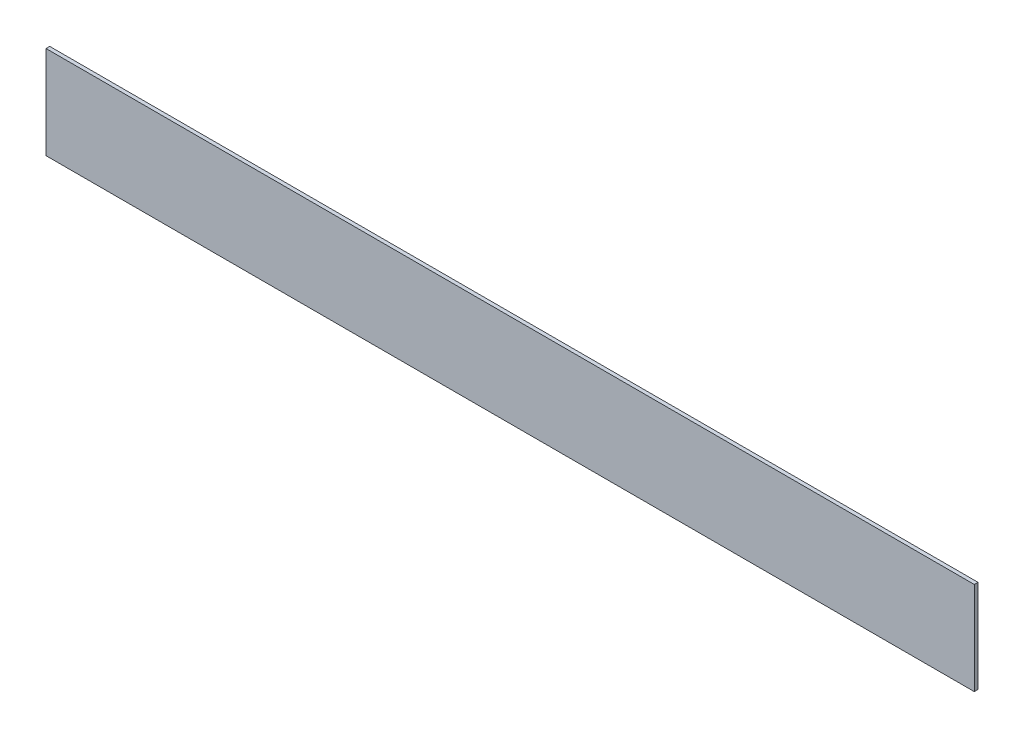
ISO-10303-21;
HEADER;
FILE_DESCRIPTION(('STEP AP214'),'2;1');
FILE_NAME('part.step','',(''),(''),'','','');
FILE_SCHEMA(('AUTOMOTIVE_DESIGN { 1 0 10303 214 1 1 1 1 }'));
ENDSEC;
DATA;
#1=APPLICATION_CONTEXT('core data for automotive mechanical design processes');
#2=APPLICATION_PROTOCOL_DEFINITION('international standard','automotive_design',2000,#1);
#3=PRODUCT_CONTEXT('',#1,'mechanical');
#4=PRODUCT('Part','Part','',(#3));
#5=PRODUCT_RELATED_PRODUCT_CATEGORY('part','',(#4));
#6=PRODUCT_DEFINITION_FORMATION('','',#4);
#7=PRODUCT_DEFINITION_CONTEXT('part definition',#1,'design');
#8=PRODUCT_DEFINITION('design','',#6,#7);
#9=PRODUCT_DEFINITION_SHAPE('','',#8);
#10=(LENGTH_UNIT() NAMED_UNIT(*) SI_UNIT(.MILLI.,.METRE.));
#11=(NAMED_UNIT(*) PLANE_ANGLE_UNIT() SI_UNIT($,.RADIAN.));
#12=(NAMED_UNIT(*) SI_UNIT($,.STERADIAN.) SOLID_ANGLE_UNIT());
#13=UNCERTAINTY_MEASURE_WITH_UNIT(LENGTH_MEASURE(1.E-05),#10,'distance_accuracy_value','');
#14=(GEOMETRIC_REPRESENTATION_CONTEXT(3) GLOBAL_UNCERTAINTY_ASSIGNED_CONTEXT((#13)) GLOBAL_UNIT_ASSIGNED_CONTEXT((#10,
#11,#12)) REPRESENTATION_CONTEXT('',''));
#15=CARTESIAN_POINT('',(0.,0.,0.));
#16=DIRECTION('',(0.,0.,1.));
#17=DIRECTION('',(1.,0.,0.));
#18=AXIS2_PLACEMENT_3D('',#15,#16,#17);
#19=CARTESIAN_POINT('',(0.,0.,8.));
#20=DIRECTION('',(0.,0.,1.));
#21=DIRECTION('',(1.,0.,0.));
#22=AXIS2_PLACEMENT_3D('',#19,#20,#21);
#23=PLANE('',#22);
#24=DIRECTION('',(1.,0.,0.));
#25=VECTOR('',#24,1.);
#26=CARTESIAN_POINT('',(-1000.,-100.,8.));
#27=LINE('',#26,#25);
#28=CARTESIAN_POINT('',(-1000.,-100.,8.));
#29=VERTEX_POINT('',#28);
#30=CARTESIAN_POINT('',(1000.,-100.,8.));
#31=VERTEX_POINT('',#30);
#32=EDGE_CURVE('E82',#29,#31,#27,.T.);
#33=ORIENTED_EDGE('',*,*,#32,.T.);
#34=DIRECTION('',(0.,1.,0.));
#35=VECTOR('',#34,1.);
#36=CARTESIAN_POINT('',(1000.,-100.,8.));
#37=LINE('',#36,#35);
#38=CARTESIAN_POINT('',(1000.,100.,8.));
#39=VERTEX_POINT('',#38);
#40=EDGE_CURVE('E101',#31,#39,#37,.T.);
#41=ORIENTED_EDGE('',*,*,#40,.T.);
#42=DIRECTION('',(-1.,0.,0.));
#43=VECTOR('',#42,1.);
#44=CARTESIAN_POINT('',(1000.,100.,8.));
#45=LINE('',#44,#43);
#46=CARTESIAN_POINT('',(-1000.,100.,8.));
#47=VERTEX_POINT('',#46);
#48=EDGE_CURVE('E74',#39,#47,#45,.T.);
#49=ORIENTED_EDGE('',*,*,#48,.T.);
#50=DIRECTION('',(0.,-1.,0.));
#51=VECTOR('',#50,1.);
#52=CARTESIAN_POINT('',(-1000.,100.,8.));
#53=LINE('',#52,#51);
#54=EDGE_CURVE('E10',#47,#29,#53,.T.);
#55=ORIENTED_EDGE('',*,*,#54,.T.);
#56=EDGE_LOOP('',(#33,#41,#49,#55));
#57=FACE_BOUND('',#56,.T.);
#58=ADVANCED_FACE('F16',(#57),#23,.T.);
#59=CARTESIAN_POINT('',(0.,0.,0.));
#60=DIRECTION('',(0.,0.,1.));
#61=DIRECTION('',(1.,0.,0.));
#62=AXIS2_PLACEMENT_3D('',#59,#60,#61);
#63=PLANE('',#62);
#64=DIRECTION('',(0.,-1.,0.));
#65=VECTOR('',#64,1.);
#66=CARTESIAN_POINT('',(-1000.,100.,0.));
#67=LINE('',#66,#65);
#68=CARTESIAN_POINT('',(-1000.,100.,0.));
#69=VERTEX_POINT('',#68);
#70=CARTESIAN_POINT('',(-1000.,-100.,0.));
#71=VERTEX_POINT('',#70);
#72=EDGE_CURVE('E25',#69,#71,#67,.T.);
#73=ORIENTED_EDGE('',*,*,#72,.F.);
#74=DIRECTION('',(-1.,0.,0.));
#75=VECTOR('',#74,1.);
#76=CARTESIAN_POINT('',(1000.,100.,0.));
#77=LINE('',#76,#75);
#78=CARTESIAN_POINT('',(1000.,100.,0.));
#79=VERTEX_POINT('',#78);
#80=EDGE_CURVE('E98',#79,#69,#77,.T.);
#81=ORIENTED_EDGE('',*,*,#80,.F.);
#82=DIRECTION('',(0.,1.,0.));
#83=VECTOR('',#82,1.);
#84=CARTESIAN_POINT('',(1000.,-100.,0.));
#85=LINE('',#84,#83);
#86=CARTESIAN_POINT('',(1000.,-100.,0.));
#87=VERTEX_POINT('',#86);
#88=EDGE_CURVE('E84',#87,#79,#85,.T.);
#89=ORIENTED_EDGE('',*,*,#88,.F.);
#90=DIRECTION('',(1.,0.,0.));
#91=VECTOR('',#90,1.);
#92=CARTESIAN_POINT('',(-1000.,-100.,0.));
#93=LINE('',#92,#91);
#94=EDGE_CURVE('E80',#71,#87,#93,.T.);
#95=ORIENTED_EDGE('',*,*,#94,.F.);
#96=EDGE_LOOP('',(#73,#81,#89,#95));
#97=FACE_BOUND('',#96,.T.);
#98=ADVANCED_FACE('F86',(#97),#63,.F.);
#99=CARTESIAN_POINT('',(-1000.,100.,0.));
#100=DIRECTION('',(1.,0.,0.));
#101=DIRECTION('',(0.,1.,0.));
#102=AXIS2_PLACEMENT_3D('',#99,#100,#101);
#103=PLANE('',#102);
#104=ORIENTED_EDGE('',*,*,#72,.T.);
#105=DIRECTION('',(0.,0.,1.));
#106=VECTOR('',#105,1.);
#107=CARTESIAN_POINT('',(-1000.,-100.,0.));
#108=LINE('',#107,#106);
#109=EDGE_CURVE('E69',#71,#29,#108,.T.);
#110=ORIENTED_EDGE('',*,*,#109,.T.);
#111=ORIENTED_EDGE('',*,*,#54,.F.);
#112=DIRECTION('',(0.,0.,1.));
#113=VECTOR('',#112,1.);
#114=CARTESIAN_POINT('',(-1000.,100.,0.));
#115=LINE('',#114,#113);
#116=EDGE_CURVE('E19',#69,#47,#115,.T.);
#117=ORIENTED_EDGE('',*,*,#116,.F.);
#118=EDGE_LOOP('',(#104,#110,#111,#117));
#119=FACE_BOUND('',#118,.T.);
#120=ADVANCED_FACE('F68',(#119),#103,.F.);
#121=CARTESIAN_POINT('',(1000.,100.,0.));
#122=DIRECTION('',(0.,-1.,0.));
#123=DIRECTION('',(0.,0.,-1.));
#124=AXIS2_PLACEMENT_3D('',#121,#122,#123);
#125=PLANE('',#124);
#126=ORIENTED_EDGE('',*,*,#80,.T.);
#127=ORIENTED_EDGE('',*,*,#116,.T.);
#128=ORIENTED_EDGE('',*,*,#48,.F.);
#129=DIRECTION('',(0.,0.,1.));
#130=VECTOR('',#129,1.);
#131=CARTESIAN_POINT('',(1000.,100.,0.));
#132=LINE('',#131,#130);
#133=EDGE_CURVE('E105',#79,#39,#132,.T.);
#134=ORIENTED_EDGE('',*,*,#133,.F.);
#135=EDGE_LOOP('',(#126,#127,#128,#134));
#136=FACE_BOUND('',#135,.T.);
#137=ADVANCED_FACE('F117',(#136),#125,.F.);
#138=CARTESIAN_POINT('',(1000.,-100.,0.));
#139=DIRECTION('',(-1.,0.,0.));
#140=DIRECTION('',(0.,0.,1.));
#141=AXIS2_PLACEMENT_3D('',#138,#139,#140);
#142=PLANE('',#141);
#143=ORIENTED_EDGE('',*,*,#88,.T.);
#144=ORIENTED_EDGE('',*,*,#133,.T.);
#145=ORIENTED_EDGE('',*,*,#40,.F.);
#146=DIRECTION('',(0.,0.,1.));
#147=VECTOR('',#146,1.);
#148=CARTESIAN_POINT('',(1000.,-100.,0.));
#149=LINE('',#148,#147);
#150=EDGE_CURVE('E90',#87,#31,#149,.T.);
#151=ORIENTED_EDGE('',*,*,#150,.F.);
#152=EDGE_LOOP('',(#143,#144,#145,#151));
#153=FACE_BOUND('',#152,.T.);
#154=ADVANCED_FACE('F120',(#153),#142,.F.);
#155=CARTESIAN_POINT('',(-1000.,-100.,0.));
#156=DIRECTION('',(0.,1.,0.));
#157=DIRECTION('',(1.,0.,0.));
#158=AXIS2_PLACEMENT_3D('',#155,#156,#157);
#159=PLANE('',#158);
#160=ORIENTED_EDGE('',*,*,#94,.T.);
#161=ORIENTED_EDGE('',*,*,#150,.T.);
#162=ORIENTED_EDGE('',*,*,#32,.F.);
#163=ORIENTED_EDGE('',*,*,#109,.F.);
#164=EDGE_LOOP('',(#160,#161,#162,#163));
#165=FACE_BOUND('',#164,.T.);
#166=ADVANCED_FACE('F78',(#165),#159,.F.);
#167=CLOSED_SHELL('',(#58,#98,#120,#137,#154,#166));
#168=MANIFOLD_SOLID_BREP('B1',#167);
#169=ADVANCED_BREP_SHAPE_REPRESENTATION('',(#18,#168),#14);
#170=SHAPE_DEFINITION_REPRESENTATION(#9,#169);
ENDSEC;
END-ISO-10303-21;
